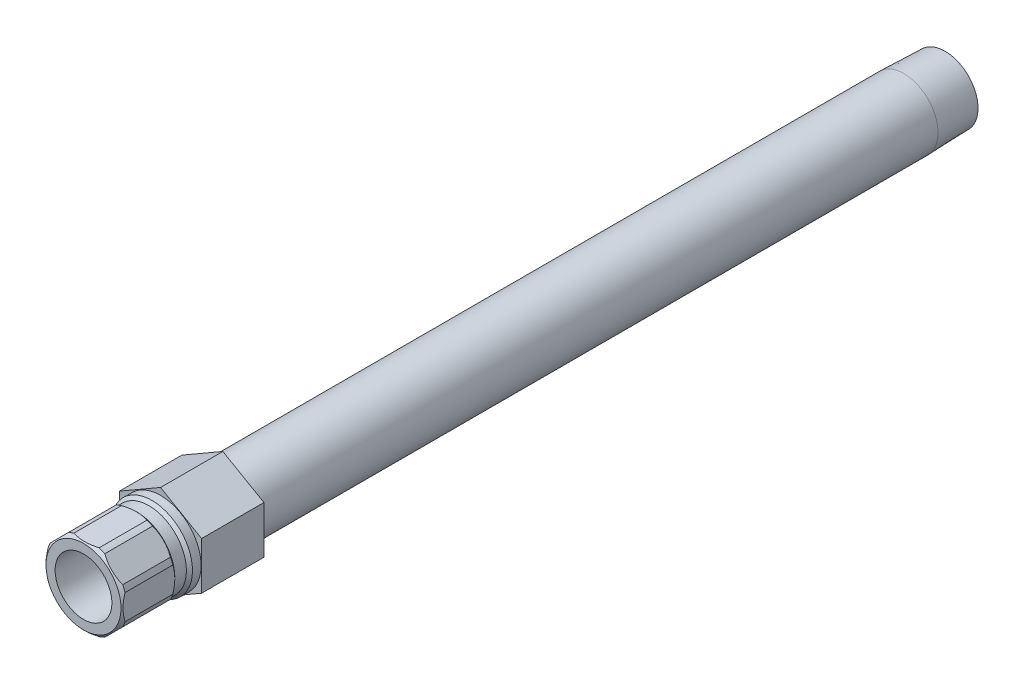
from build123d import *

# Parameters (mm, degrees)
SKETCH2_R           = 6.2611
BOSS_EXTRUDE1_DEPTH = 15.621
CUT_EXTRUDE1_START  = 5.8166
SKETCH3_OUTSIDE_W   = 66.21
SKETCH3_OUTSIDE_H   = 69.392
CUT_EXTRUDE1_DEPTH  = 192.406385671


with BuildPart() as part:
    # Sketch1 → Revolve1 (revolve)
    with BuildSketch(Plane(origin=(0, 0, 0), x_dir=(0, 0, -1), z_dir=(1, 0, 0))):
        Polygon((-19.304, 7.112), (-19.304, 9.398), (-18.542, 10.16), (-6.5786, 10.16), (-5.8166, 9.398), (-2.921, 9.398), (-2.159, 10.16), (0, 10.16), (0, 8.5725), (186.2582, 8.5725), (196.596, 8.249445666), (196.596, 6.2611), (-0.6731, 6.2611), (-1.524, 7.112), align=None)
    revolve(axis=Axis((0, 0, 0), (0, 0, 1)))

    # Sketch2 → Boss-Extrude1 (add)
    with BuildSketch(Plane.XY):
        Polygon((-10.287, 5.939202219), (-10.287, -5.939202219), (0, -11.878404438), (10.287, -5.939202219), (10.287, 5.939202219), (0, 11.878404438), align=None)
        with Locations(Location((0, 0, 0), (0, 0, 90))):
            Circle(SKETCH2_R, mode=Mode.SUBTRACT)
    extrude(amount=-BOSS_EXTRUDE1_DEPTH)

    # Sketch3 outside → Cut-Extrude1 (cut, through all)
    with BuildSketch(Plane.XY.offset(CUT_EXTRUDE1_START)):
        Rectangle(SKETCH3_OUTSIDE_W, SKETCH3_OUTSIDE_H)
        Polygon((9.652, -3.997989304), (9.652, 3.997989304), (3.997989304, 9.652), (-3.997989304, 9.652), (-9.652, 3.997989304), (-9.652, -3.997989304), (-3.997989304, -9.652), (3.997989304, -9.652), align=None, mode=Mode.SUBTRACT)
    extrude(amount=CUT_EXTRUDE1_DEPTH, mode=Mode.SUBTRACT)


solid = part.part
